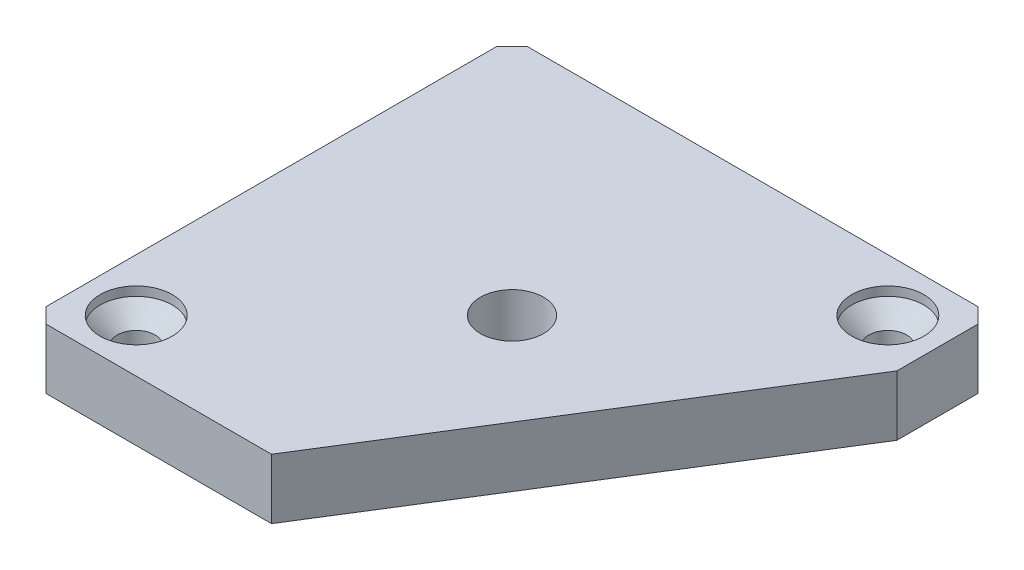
ISO-10303-21;
HEADER;
FILE_DESCRIPTION(('STEP AP214'),'2;1');
FILE_NAME('part.step','',(''),(''),'','','');
FILE_SCHEMA(('AUTOMOTIVE_DESIGN { 1 0 10303 214 1 1 1 1 }'));
ENDSEC;
DATA;
#1=APPLICATION_CONTEXT('core data for automotive mechanical design processes');
#2=APPLICATION_PROTOCOL_DEFINITION('international standard','automotive_design',2000,#1);
#3=PRODUCT_CONTEXT('',#1,'mechanical');
#4=PRODUCT('Part','Part','',(#3));
#5=PRODUCT_RELATED_PRODUCT_CATEGORY('part','',(#4));
#6=PRODUCT_DEFINITION_FORMATION('','',#4);
#7=PRODUCT_DEFINITION_CONTEXT('part definition',#1,'design');
#8=PRODUCT_DEFINITION('design','',#6,#7);
#9=PRODUCT_DEFINITION_SHAPE('','',#8);
#10=(LENGTH_UNIT() NAMED_UNIT(*) SI_UNIT(.MILLI.,.METRE.));
#11=(NAMED_UNIT(*) PLANE_ANGLE_UNIT() SI_UNIT($,.RADIAN.));
#12=(NAMED_UNIT(*) SI_UNIT($,.STERADIAN.) SOLID_ANGLE_UNIT());
#13=UNCERTAINTY_MEASURE_WITH_UNIT(LENGTH_MEASURE(1.E-05),#10,'distance_accuracy_value','');
#14=(GEOMETRIC_REPRESENTATION_CONTEXT(3) GLOBAL_UNCERTAINTY_ASSIGNED_CONTEXT((#13)) GLOBAL_UNIT_ASSIGNED_CONTEXT((#10,
#11,#12)) REPRESENTATION_CONTEXT('',''));
#15=CARTESIAN_POINT('',(0.,0.,0.));
#16=DIRECTION('',(0.,0.,1.));
#17=DIRECTION('',(1.,0.,0.));
#18=AXIS2_PLACEMENT_3D('',#15,#16,#17);
#19=CARTESIAN_POINT('',(0.,20.,0.));
#20=DIRECTION('',(1.,0.,0.));
#21=DIRECTION('',(0.,0.,-1.));
#22=AXIS2_PLACEMENT_3D('',#19,#20,#21);
#23=PLANE('',#22);
#24=DIRECTION('',(0.,0.,1.));
#25=VECTOR('',#24,1.);
#26=CARTESIAN_POINT('',(0.,20.,0.));
#27=LINE('',#26,#25);
#28=CARTESIAN_POINT('',(0.,20.,-155.));
#29=VERTEX_POINT('',#28);
#30=CARTESIAN_POINT('',(0.,20.,-5.00000000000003));
#31=VERTEX_POINT('',#30);
#32=EDGE_CURVE('E123',#29,#31,#27,.T.);
#33=ORIENTED_EDGE('',*,*,#32,.F.);
#34=DIRECTION('',(0.,-1.,0.));
#35=VECTOR('',#34,1.);
#36=CARTESIAN_POINT('',(0.,20.,-155.));
#37=LINE('',#36,#35);
#38=CARTESIAN_POINT('',(0.,0.,-155.));
#39=VERTEX_POINT('',#38);
#40=EDGE_CURVE('E140',#29,#39,#37,.T.);
#41=ORIENTED_EDGE('',*,*,#40,.T.);
#42=DIRECTION('',(0.,0.,1.));
#43=VECTOR('',#42,1.);
#44=CARTESIAN_POINT('',(0.,0.,0.));
#45=LINE('',#44,#43);
#46=CARTESIAN_POINT('',(0.,0.,-5.00000000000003));
#47=VERTEX_POINT('',#46);
#48=EDGE_CURVE('E125',#39,#47,#45,.T.);
#49=ORIENTED_EDGE('',*,*,#48,.T.);
#50=DIRECTION('',(0.,1.,0.));
#51=VECTOR('',#50,1.);
#52=CARTESIAN_POINT('',(0.,20.,-5.00000000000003));
#53=LINE('',#52,#51);
#54=EDGE_CURVE('E138',#47,#31,#53,.T.);
#55=ORIENTED_EDGE('',*,*,#54,.T.);
#56=EDGE_LOOP('',(#33,#41,#49,#55));
#57=FACE_BOUND('',#56,.T.);
#58=ADVANCED_FACE('F36',(#57),#23,.F.);
#59=CARTESIAN_POINT('',(0.,20.,0.));
#60=DIRECTION('',(0.,0.,-1.));
#61=DIRECTION('',(-1.,0.,0.));
#62=AXIS2_PLACEMENT_3D('',#59,#60,#61);
#63=PLANE('',#62);
#64=DIRECTION('',(1.,0.,0.));
#65=VECTOR('',#64,1.);
#66=CARTESIAN_POINT('',(0.,0.,0.));
#67=LINE('',#66,#65);
#68=CARTESIAN_POINT('',(5.,0.,0.));
#69=VERTEX_POINT('',#68);
#70=CARTESIAN_POINT('',(79.9999999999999,0.,0.));
#71=VERTEX_POINT('',#70);
#72=EDGE_CURVE('E120',#69,#71,#67,.T.);
#73=ORIENTED_EDGE('',*,*,#72,.T.);
#74=DIRECTION('',(0.,-1.,0.));
#75=VECTOR('',#74,1.);
#76=CARTESIAN_POINT('',(80.,20.,0.));
#77=LINE('',#76,#75);
#78=CARTESIAN_POINT('',(80.,20.,0.));
#79=VERTEX_POINT('',#78);
#80=EDGE_CURVE('E50',#79,#71,#77,.T.);
#81=ORIENTED_EDGE('',*,*,#80,.F.);
#82=DIRECTION('',(1.,0.,0.));
#83=VECTOR('',#82,1.);
#84=CARTESIAN_POINT('',(0.,20.,0.));
#85=LINE('',#84,#83);
#86=CARTESIAN_POINT('',(5.,20.,0.));
#87=VERTEX_POINT('',#86);
#88=EDGE_CURVE('E131',#87,#79,#85,.T.);
#89=ORIENTED_EDGE('',*,*,#88,.F.);
#90=DIRECTION('',(0.,-1.,0.));
#91=VECTOR('',#90,1.);
#92=CARTESIAN_POINT('',(5.,20.,0.));
#93=LINE('',#92,#91);
#94=EDGE_CURVE('E11',#87,#69,#93,.T.);
#95=ORIENTED_EDGE('',*,*,#94,.T.);
#96=EDGE_LOOP('',(#73,#81,#89,#95));
#97=FACE_BOUND('',#96,.T.);
#98=ADVANCED_FACE('F182',(#97),#63,.F.);
#99=CARTESIAN_POINT('',(160.,20.,0.));
#100=DIRECTION('',(-1.,0.,0.));
#101=DIRECTION('',(0.,0.,1.));
#102=AXIS2_PLACEMENT_3D('',#99,#100,#101);
#103=PLANE('',#102);
#104=DIRECTION('',(0.,0.,-1.));
#105=VECTOR('',#104,1.);
#106=CARTESIAN_POINT('',(160.,20.,0.));
#107=LINE('',#106,#105);
#108=CARTESIAN_POINT('',(160.,20.,-128.026762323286));
#109=VERTEX_POINT('',#108);
#110=CARTESIAN_POINT('',(160.,20.,-155.));
#111=VERTEX_POINT('',#110);
#112=EDGE_CURVE('E58',#109,#111,#107,.T.);
#113=ORIENTED_EDGE('',*,*,#112,.F.);
#114=DIRECTION('',(0.,-1.,0.));
#115=VECTOR('',#114,1.);
#116=CARTESIAN_POINT('',(160.,20.,-128.026762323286));
#117=LINE('',#116,#115);
#118=CARTESIAN_POINT('',(160.,0.,-128.026762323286));
#119=VERTEX_POINT('',#118);
#120=EDGE_CURVE('E101',#109,#119,#117,.T.);
#121=ORIENTED_EDGE('',*,*,#120,.T.);
#122=DIRECTION('',(0.,0.,-1.));
#123=VECTOR('',#122,1.);
#124=CARTESIAN_POINT('',(160.,0.,0.));
#125=LINE('',#124,#123);
#126=CARTESIAN_POINT('',(160.,0.,-155.));
#127=VERTEX_POINT('',#126);
#128=EDGE_CURVE('E110',#119,#127,#125,.T.);
#129=ORIENTED_EDGE('',*,*,#128,.T.);
#130=DIRECTION('',(0.,1.,0.));
#131=VECTOR('',#130,1.);
#132=CARTESIAN_POINT('',(160.,20.,-155.));
#133=LINE('',#132,#131);
#134=EDGE_CURVE('E43',#127,#111,#133,.T.);
#135=ORIENTED_EDGE('',*,*,#134,.T.);
#136=EDGE_LOOP('',(#113,#121,#129,#135));
#137=FACE_BOUND('',#136,.T.);
#138=ADVANCED_FACE('F109',(#137),#103,.F.);
#139=CARTESIAN_POINT('',(0.,20.,-160.));
#140=DIRECTION('',(0.,0.,1.));
#141=DIRECTION('',(1.,0.,0.));
#142=AXIS2_PLACEMENT_3D('',#139,#140,#141);
#143=PLANE('',#142);
#144=DIRECTION('',(-1.,0.,0.));
#145=VECTOR('',#144,1.);
#146=CARTESIAN_POINT('',(0.,0.,-160.));
#147=LINE('',#146,#145);
#148=CARTESIAN_POINT('',(155.,0.,-160.));
#149=VERTEX_POINT('',#148);
#150=CARTESIAN_POINT('',(5.00000000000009,0.,-160.));
#151=VERTEX_POINT('',#150);
#152=EDGE_CURVE('E119',#149,#151,#147,.T.);
#153=ORIENTED_EDGE('',*,*,#152,.T.);
#154=DIRECTION('',(0.,1.,0.));
#155=VECTOR('',#154,1.);
#156=CARTESIAN_POINT('',(5.00000000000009,20.,-160.));
#157=LINE('',#156,#155);
#158=CARTESIAN_POINT('',(5.00000000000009,20.,-160.));
#159=VERTEX_POINT('',#158);
#160=EDGE_CURVE('E151',#151,#159,#157,.T.);
#161=ORIENTED_EDGE('',*,*,#160,.T.);
#162=DIRECTION('',(-1.,0.,0.));
#163=VECTOR('',#162,1.);
#164=CARTESIAN_POINT('',(0.,20.,-160.));
#165=LINE('',#164,#163);
#166=CARTESIAN_POINT('',(155.,20.,-160.));
#167=VERTEX_POINT('',#166);
#168=EDGE_CURVE('E135',#167,#159,#165,.T.);
#169=ORIENTED_EDGE('',*,*,#168,.F.);
#170=DIRECTION('',(0.,-1.,0.));
#171=VECTOR('',#170,1.);
#172=CARTESIAN_POINT('',(155.,20.,-160.));
#173=LINE('',#172,#171);
#174=EDGE_CURVE('E148',#167,#149,#173,.T.);
#175=ORIENTED_EDGE('',*,*,#174,.T.);
#176=EDGE_LOOP('',(#153,#161,#169,#175));
#177=FACE_BOUND('',#176,.T.);
#178=ADVANCED_FACE('F166',(#177),#143,.F.);
#179=CARTESIAN_POINT('',(0.,20.,-160.));
#180=DIRECTION('',(0.,-1.,0.));
#181=DIRECTION('',(0.,0.,-1.));
#182=AXIS2_PLACEMENT_3D('',#179,#180,#181);
#183=PLANE('',#182);
#184=CARTESIAN_POINT('',(142.5,20.,-142.5));
#185=DIRECTION('',(0.,1.,0.));
#186=DIRECTION('',(0.,0.,1.));
#187=AXIS2_PLACEMENT_3D('',#184,#185,#186);
#188=CIRCLE('',#187,12.);
#189=CARTESIAN_POINT('',(142.5,20.,-130.5));
#190=VERTEX_POINT('',#189);
#191=EDGE_CURVE('E203',#190,#190,#188,.T.);
#192=ORIENTED_EDGE('',*,*,#191,.F.);
#193=EDGE_LOOP('',(#192));
#194=FACE_BOUND('',#193,.T.);
#195=CARTESIAN_POINT('',(17.5,20.,-17.5));
#196=DIRECTION('',(0.,1.,0.));
#197=DIRECTION('',(0.,0.,1.));
#198=AXIS2_PLACEMENT_3D('',#195,#196,#197);
#199=CIRCLE('',#198,12.);
#200=CARTESIAN_POINT('',(17.5,20.,-5.50000000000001));
#201=VERTEX_POINT('',#200);
#202=EDGE_CURVE('E206',#201,#201,#199,.T.);
#203=ORIENTED_EDGE('',*,*,#202,.F.);
#204=EDGE_LOOP('',(#203));
#205=FACE_BOUND('',#204,.T.);
#206=CARTESIAN_POINT('',(80.,20.,-80.));
#207=DIRECTION('',(0.,1.,0.));
#208=DIRECTION('',(0.,0.,1.));
#209=AXIS2_PLACEMENT_3D('',#206,#207,#208);
#210=CIRCLE('',#209,10.5);
#211=CARTESIAN_POINT('',(80.,20.,-69.5));
#212=VERTEX_POINT('',#211);
#213=EDGE_CURVE('E209',#212,#212,#210,.T.);
#214=ORIENTED_EDGE('',*,*,#213,.F.);
#215=EDGE_LOOP('',(#214));
#216=FACE_BOUND('',#215,.T.);
#217=ORIENTED_EDGE('',*,*,#88,.T.);
#218=DIRECTION('',(0.5299192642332,0.,-0.848048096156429));
#219=VECTOR('',#218,1.);
#220=CARTESIAN_POINT('',(80.,20.,0.));
#221=LINE('',#220,#219);
#222=EDGE_CURVE('E106',#79,#109,#221,.T.);
#223=ORIENTED_EDGE('',*,*,#222,.T.);
#224=ORIENTED_EDGE('',*,*,#112,.T.);
#225=DIRECTION('',(0.707106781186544,0.,0.707106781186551));
#226=VECTOR('',#225,1.);
#227=CARTESIAN_POINT('',(155.,20.,-160.));
#228=LINE('',#227,#226);
#229=EDGE_CURVE('E155',#111,#167,#228,.F.);
#230=ORIENTED_EDGE('',*,*,#229,.T.);
#231=ORIENTED_EDGE('',*,*,#168,.T.);
#232=DIRECTION('',(0.707106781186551,0.,-0.707106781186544));
#233=VECTOR('',#232,1.);
#234=CARTESIAN_POINT('',(0.,20.,-155.));
#235=LINE('',#234,#233);
#236=EDGE_CURVE('E157',#159,#29,#235,.F.);
#237=ORIENTED_EDGE('',*,*,#236,.T.);
#238=ORIENTED_EDGE('',*,*,#32,.T.);
#239=DIRECTION('',(-0.707106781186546,0.,-0.707106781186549));
#240=VECTOR('',#239,1.);
#241=CARTESIAN_POINT('',(5.,20.,0.));
#242=LINE('',#241,#240);
#243=EDGE_CURVE('E153',#31,#87,#242,.F.);
#244=ORIENTED_EDGE('',*,*,#243,.T.);
#245=EDGE_LOOP('',(#217,#223,#224,#230,#231,#237,#238,#244));
#246=FACE_BOUND('',#245,.T.);
#247=ADVANCED_FACE('F163',(#194,#205,#216,#246),#183,.F.);
#248=CARTESIAN_POINT('',(0.,0.,-160.));
#249=DIRECTION('',(0.,-1.,0.));
#250=DIRECTION('',(0.,0.,-1.));
#251=AXIS2_PLACEMENT_3D('',#248,#249,#250);
#252=PLANE('',#251);
#253=DIRECTION('',(0.5299192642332,0.,-0.848048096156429));
#254=VECTOR('',#253,1.);
#255=CARTESIAN_POINT('',(80.,0.,0.));
#256=LINE('',#255,#254);
#257=EDGE_CURVE('E98',#71,#119,#256,.T.);
#258=ORIENTED_EDGE('',*,*,#257,.F.);
#259=ORIENTED_EDGE('',*,*,#72,.F.);
#260=DIRECTION('',(0.707106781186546,0.,0.707106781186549));
#261=VECTOR('',#260,1.);
#262=CARTESIAN_POINT('',(-77.5,0.,-82.5000000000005));
#263=LINE('',#262,#261);
#264=EDGE_CURVE('E143',#69,#47,#263,.F.);
#265=ORIENTED_EDGE('',*,*,#264,.T.);
#266=ORIENTED_EDGE('',*,*,#48,.F.);
#267=DIRECTION('',(-0.707106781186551,0.,0.707106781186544));
#268=VECTOR('',#267,1.);
#269=CARTESIAN_POINT('',(2.50000000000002,0.,-157.5));
#270=LINE('',#269,#268);
#271=EDGE_CURVE('E146',#39,#151,#270,.F.);
#272=ORIENTED_EDGE('',*,*,#271,.T.);
#273=ORIENTED_EDGE('',*,*,#152,.F.);
#274=DIRECTION('',(-0.707106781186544,0.,-0.707106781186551));
#275=VECTOR('',#274,1.);
#276=CARTESIAN_POINT('',(77.5000000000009,0.,-237.5));
#277=LINE('',#276,#275);
#278=EDGE_CURVE('E117',#149,#127,#277,.F.);
#279=ORIENTED_EDGE('',*,*,#278,.T.);
#280=ORIENTED_EDGE('',*,*,#128,.F.);
#281=EDGE_LOOP('',(#258,#259,#265,#266,#272,#273,#279,#280));
#282=FACE_BOUND('',#281,.T.);
#283=CARTESIAN_POINT('',(17.5,0.,-17.5));
#284=DIRECTION('',(0.,1.,0.));
#285=DIRECTION('',(0.,0.,1.));
#286=AXIS2_PLACEMENT_3D('',#283,#284,#285);
#287=CIRCLE('',#286,6.25);
#288=CARTESIAN_POINT('',(17.5,0.,-11.25));
#289=VERTEX_POINT('',#288);
#290=EDGE_CURVE('E191',#289,#289,#287,.T.);
#291=ORIENTED_EDGE('',*,*,#290,.T.);
#292=EDGE_LOOP('',(#291));
#293=FACE_BOUND('',#292,.T.);
#294=CARTESIAN_POINT('',(142.5,0.,-142.5));
#295=DIRECTION('',(0.,1.,0.));
#296=DIRECTION('',(0.,0.,1.));
#297=AXIS2_PLACEMENT_3D('',#294,#295,#296);
#298=CIRCLE('',#297,6.25000000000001);
#299=CARTESIAN_POINT('',(142.5,0.,-136.25));
#300=VERTEX_POINT('',#299);
#301=EDGE_CURVE('E200',#300,#300,#298,.T.);
#302=ORIENTED_EDGE('',*,*,#301,.T.);
#303=EDGE_LOOP('',(#302));
#304=FACE_BOUND('',#303,.T.);
#305=CARTESIAN_POINT('',(80.,0.,-80.));
#306=DIRECTION('',(0.,1.,0.));
#307=DIRECTION('',(0.,0.,1.));
#308=AXIS2_PLACEMENT_3D('',#305,#306,#307);
#309=CIRCLE('',#308,10.5);
#310=CARTESIAN_POINT('',(80.,0.,-69.5));
#311=VERTEX_POINT('',#310);
#312=EDGE_CURVE('E212',#311,#311,#309,.T.);
#313=ORIENTED_EDGE('',*,*,#312,.T.);
#314=EDGE_LOOP('',(#313));
#315=FACE_BOUND('',#314,.T.);
#316=ADVANCED_FACE('F114',(#282,#293,#304,#315),#252,.T.);
#317=CARTESIAN_POINT('',(80.,0.,-80.));
#318=DIRECTION('',(0.,1.,0.));
#319=DIRECTION('',(0.,0.,1.));
#320=AXIS2_PLACEMENT_3D('',#317,#318,#319);
#321=CYLINDRICAL_SURFACE('',#320,10.5);
#322=ORIENTED_EDGE('',*,*,#312,.F.);
#323=EDGE_LOOP('',(#322));
#324=FACE_BOUND('',#323,.T.);
#325=ORIENTED_EDGE('',*,*,#213,.T.);
#326=EDGE_LOOP('',(#325));
#327=FACE_BOUND('',#326,.T.);
#328=ADVANCED_FACE('F217',(#324,#327),#321,.F.);
#329=CARTESIAN_POINT('',(0.,20.,-155.));
#330=DIRECTION('',(0.707106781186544,0.,0.707106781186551));
#331=DIRECTION('',(0.707106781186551,0.,-0.707106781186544));
#332=AXIS2_PLACEMENT_3D('',#329,#330,#331);
#333=PLANE('',#332);
#334=ORIENTED_EDGE('',*,*,#236,.F.);
#335=ORIENTED_EDGE('',*,*,#160,.F.);
#336=ORIENTED_EDGE('',*,*,#271,.F.);
#337=ORIENTED_EDGE('',*,*,#40,.F.);
#338=EDGE_LOOP('',(#334,#335,#336,#337));
#339=FACE_BOUND('',#338,.T.);
#340=ADVANCED_FACE('F169',(#339),#333,.F.);
#341=CARTESIAN_POINT('',(155.,20.,-160.));
#342=DIRECTION('',(-0.707106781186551,0.,0.707106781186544));
#343=DIRECTION('',(0.707106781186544,0.,0.707106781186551));
#344=AXIS2_PLACEMENT_3D('',#341,#342,#343);
#345=PLANE('',#344);
#346=ORIENTED_EDGE('',*,*,#229,.F.);
#347=ORIENTED_EDGE('',*,*,#134,.F.);
#348=ORIENTED_EDGE('',*,*,#278,.F.);
#349=ORIENTED_EDGE('',*,*,#174,.F.);
#350=EDGE_LOOP('',(#346,#347,#348,#349));
#351=FACE_BOUND('',#350,.T.);
#352=ADVANCED_FACE('F161',(#351),#345,.F.);
#353=CARTESIAN_POINT('',(5.,20.,0.));
#354=DIRECTION('',(0.707106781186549,0.,-0.707106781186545));
#355=DIRECTION('',(-0.707106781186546,0.,-0.707106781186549));
#356=AXIS2_PLACEMENT_3D('',#353,#354,#355);
#357=PLANE('',#356);
#358=ORIENTED_EDGE('',*,*,#243,.F.);
#359=ORIENTED_EDGE('',*,*,#54,.F.);
#360=ORIENTED_EDGE('',*,*,#264,.F.);
#361=ORIENTED_EDGE('',*,*,#94,.F.);
#362=EDGE_LOOP('',(#358,#359,#360,#361));
#363=FACE_BOUND('',#362,.T.);
#364=ADVANCED_FACE('F178',(#363),#357,.F.);
#365=CARTESIAN_POINT('',(17.5,17.,-17.5));
#366=DIRECTION('',(0.,1.,0.));
#367=DIRECTION('',(0.,0.,1.));
#368=AXIS2_PLACEMENT_3D('',#365,#366,#367);
#369=CYLINDRICAL_SURFACE('',#368,12.);
#370=CARTESIAN_POINT('',(17.5,17.,-17.5));
#371=DIRECTION('',(0.,1.,0.));
#372=DIRECTION('',(0.,0.,1.));
#373=AXIS2_PLACEMENT_3D('',#370,#371,#372);
#374=CIRCLE('',#373,12.);
#375=CARTESIAN_POINT('',(17.5,17.,-5.50000000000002));
#376=VERTEX_POINT('',#375);
#377=EDGE_CURVE('E112',#376,#376,#374,.T.);
#378=ORIENTED_EDGE('',*,*,#377,.F.);
#379=EDGE_LOOP('',(#378));
#380=FACE_BOUND('',#379,.T.);
#381=ORIENTED_EDGE('',*,*,#202,.T.);
#382=EDGE_LOOP('',(#381));
#383=FACE_BOUND('',#382,.T.);
#384=ADVANCED_FACE('F278',(#380,#383),#369,.F.);
#385=CARTESIAN_POINT('',(142.5,17.,-142.5));
#386=DIRECTION('',(0.,1.,0.));
#387=DIRECTION('',(0.,0.,1.));
#388=AXIS2_PLACEMENT_3D('',#385,#386,#387);
#389=CYLINDRICAL_SURFACE('',#388,12.);
#390=CARTESIAN_POINT('',(142.5,17.,-142.5));
#391=DIRECTION('',(0.,1.,0.));
#392=DIRECTION('',(0.,0.,1.));
#393=AXIS2_PLACEMENT_3D('',#390,#391,#392);
#394=CIRCLE('',#393,12.);
#395=CARTESIAN_POINT('',(142.5,17.,-130.5));
#396=VERTEX_POINT('',#395);
#397=EDGE_CURVE('E194',#396,#396,#394,.T.);
#398=ORIENTED_EDGE('',*,*,#397,.F.);
#399=EDGE_LOOP('',(#398));
#400=FACE_BOUND('',#399,.T.);
#401=ORIENTED_EDGE('',*,*,#191,.T.);
#402=EDGE_LOOP('',(#401));
#403=FACE_BOUND('',#402,.T.);
#404=ADVANCED_FACE('F287',(#400,#403),#389,.F.);
#405=CARTESIAN_POINT('',(142.5,17.,-142.5));
#406=DIRECTION('',(0.,1.,0.));
#407=DIRECTION('',(0.,0.,1.));
#408=AXIS2_PLACEMENT_3D('',#405,#406,#407);
#409=CYLINDRICAL_SURFACE('',#408,6.25000000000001);
#410=ORIENTED_EDGE('',*,*,#301,.F.);
#411=EDGE_LOOP('',(#410));
#412=FACE_BOUND('',#411,.T.);
#413=CARTESIAN_POINT('',(142.5,11.25,-142.5));
#414=DIRECTION('',(0.,1.,0.));
#415=DIRECTION('',(0.,0.,1.));
#416=AXIS2_PLACEMENT_3D('',#413,#414,#415);
#417=CIRCLE('',#416,6.25000000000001);
#418=CARTESIAN_POINT('',(142.5,11.25,-136.25));
#419=VERTEX_POINT('',#418);
#420=EDGE_CURVE('E197',#419,#419,#417,.T.);
#421=ORIENTED_EDGE('',*,*,#420,.T.);
#422=EDGE_LOOP('',(#421));
#423=FACE_BOUND('',#422,.T.);
#424=ADVANCED_FACE('F297',(#412,#423),#409,.F.);
#425=CARTESIAN_POINT('',(142.5,17.,-142.5));
#426=DIRECTION('',(0.,1.,0.));
#427=DIRECTION('',(0.,0.,1.));
#428=AXIS2_PLACEMENT_3D('',#425,#426,#427);
#429=CONICAL_SURFACE('',#428,12.,0.785398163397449);
#430=ORIENTED_EDGE('',*,*,#420,.F.);
#431=EDGE_LOOP('',(#430));
#432=FACE_BOUND('',#431,.T.);
#433=ORIENTED_EDGE('',*,*,#397,.T.);
#434=EDGE_LOOP('',(#433));
#435=FACE_BOUND('',#434,.T.);
#436=ADVANCED_FACE('F307',(#432,#435),#429,.F.);
#437=CARTESIAN_POINT('',(17.5,17.,-17.5));
#438=DIRECTION('',(0.,1.,0.));
#439=DIRECTION('',(0.,0.,1.));
#440=AXIS2_PLACEMENT_3D('',#437,#438,#439);
#441=CYLINDRICAL_SURFACE('',#440,6.25);
#442=ORIENTED_EDGE('',*,*,#290,.F.);
#443=EDGE_LOOP('',(#442));
#444=FACE_BOUND('',#443,.T.);
#445=CARTESIAN_POINT('',(17.5,11.25,-17.5));
#446=DIRECTION('',(0.,1.,0.));
#447=DIRECTION('',(0.,0.,1.));
#448=AXIS2_PLACEMENT_3D('',#445,#446,#447);
#449=CIRCLE('',#448,6.25);
#450=CARTESIAN_POINT('',(17.5,11.25,-11.25));
#451=VERTEX_POINT('',#450);
#452=EDGE_CURVE('E188',#451,#451,#449,.T.);
#453=ORIENTED_EDGE('',*,*,#452,.T.);
#454=EDGE_LOOP('',(#453));
#455=FACE_BOUND('',#454,.T.);
#456=ADVANCED_FACE('F317',(#444,#455),#441,.F.);
#457=CARTESIAN_POINT('',(17.5,17.,-17.5));
#458=DIRECTION('',(0.,1.,0.));
#459=DIRECTION('',(0.,0.,1.));
#460=AXIS2_PLACEMENT_3D('',#457,#458,#459);
#461=CONICAL_SURFACE('',#460,12.,0.785398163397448);
#462=ORIENTED_EDGE('',*,*,#452,.F.);
#463=EDGE_LOOP('',(#462));
#464=FACE_BOUND('',#463,.T.);
#465=ORIENTED_EDGE('',*,*,#377,.T.);
#466=EDGE_LOOP('',(#465));
#467=FACE_BOUND('',#466,.T.);
#468=ADVANCED_FACE('F327',(#464,#467),#461,.F.);
#469=CARTESIAN_POINT('',(80.,20.,0.));
#470=DIRECTION('',(-0.848048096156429,0.,-0.5299192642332));
#471=DIRECTION('',(-0.5299192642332,0.,0.848048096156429));
#472=AXIS2_PLACEMENT_3D('',#469,#470,#471);
#473=PLANE('',#472);
#474=ORIENTED_EDGE('',*,*,#257,.T.);
#475=ORIENTED_EDGE('',*,*,#120,.F.);
#476=ORIENTED_EDGE('',*,*,#222,.F.);
#477=ORIENTED_EDGE('',*,*,#80,.T.);
#478=EDGE_LOOP('',(#474,#475,#476,#477));
#479=FACE_BOUND('',#478,.T.);
#480=ADVANCED_FACE('F100',(#479),#473,.F.);
#481=CLOSED_SHELL('',(#58,#98,#138,#178,#247,#316,#328,#340,#352,#364,#384,#404,#424,#436,#456,
#468,#480));
#482=MANIFOLD_SOLID_BREP('B2',#481);
#483=ADVANCED_BREP_SHAPE_REPRESENTATION('',(#18,#482),#14);
#484=SHAPE_DEFINITION_REPRESENTATION(#9,#483);
ENDSEC;
END-ISO-10303-21;
